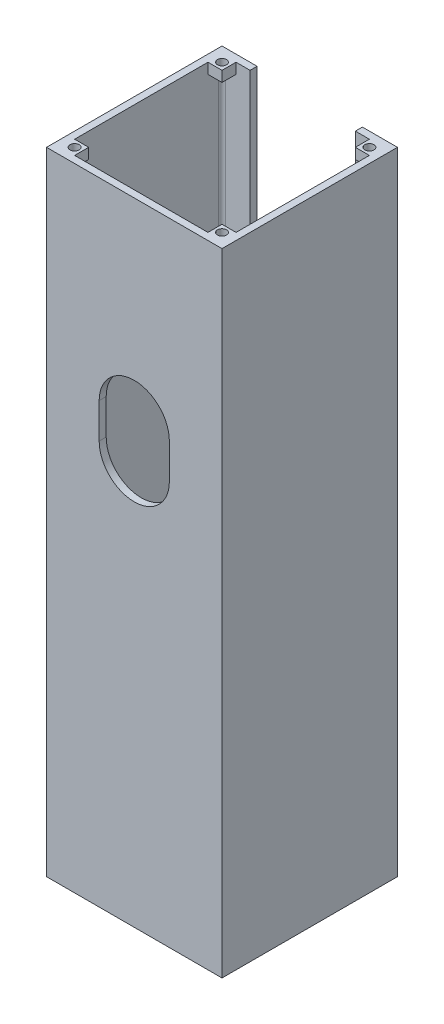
from build123d import *

# Parameters (mm, degrees)
SKETCH2_W           = 63.5
SKETCH2_H           = 63.5
BOSS_EXTRUDE2_DEPTH = 304.8
SKETCH3_W           = 58.42
SKETCH3_H           = 58.42
CUT_EXTRUDE2_DEPTH  = 302.26
SKETCH5_W           = 63.5
SKETCH5_H           = 63.5
CUT_EXTRUDE3_DEPTH  = 2.54
SKETCH6_R           = 12.7
CUT_EXTRUDE4_DEPTH  = 12.7
SKETCH11_R          = 12.7
CUT_EXTRUDE7_DEPTH  = 2.54
CUT_EXTRUDE8_DEPTH  = 2.54
SKETCH14_W          = 38.1
SKETCH14_H          = 276.86
CUT_EXTRUDE9_DEPTH  = 2.54
FILLET1_R           = 1.27
SKETCH15_W          = 63.5
SKETCH15_H          = 63.5
CUT_EXTRUDE10_DEPTH = 73.66
BOSS_EXTRUDE3_START = -3.81
SKETCH16_R          = 1.651
SKETCH16_W          = 5.08
SKETCH16_H          = 5.08
BOSS_EXTRUDE3_DEPTH = 3.81
CUT_EXTRUDE11_DEPTH = 3.81


with BuildPart() as part:
    # Sketch2 → Boss-Extrude2 (new body)
    with BuildSketch(Plane(origin=(0, 0, 0), x_dir=(1, 0, 0), z_dir=(0, 1, 0))):
        with Locations((31.75, 31.75)):
            Rectangle(SKETCH2_W, SKETCH2_H)
    extrude(amount=-BOSS_EXTRUDE2_DEPTH)

    # Sketch3 → Cut-Extrude2 (cut)
    with BuildSketch(Plane(origin=(0, 0, 0), x_dir=(1, 0, 0), z_dir=(0, 1, 0))):
        with Locations((31.75, 31.75)):
            Rectangle(SKETCH3_W, SKETCH3_H)
    extrude(amount=-CUT_EXTRUDE2_DEPTH, mode=Mode.SUBTRACT)

    # Sketch5 → Cut-Extrude3 (cut)
    with BuildSketch(Plane(origin=(0, 0, 0), x_dir=(1, 0, 0), z_dir=(0, 1, 0))):
        with Locations((31.75, 31.75)):
            Rectangle(SKETCH5_W, SKETCH5_H)
    extrude(amount=-CUT_EXTRUDE3_DEPTH, mode=Mode.SUBTRACT)

    # Sketch6 → Cut-Extrude4 (cut)
    with BuildSketch(Plane.XY):
        with Locations((31.75, -152.4)):
            Circle(SKETCH6_R)
    extrude(amount=-CUT_EXTRUDE4_DEPTH, mode=Mode.SUBTRACT)

    # Sketch11 → Cut-Extrude7 (cut)
    with BuildSketch(Plane.XY):
        with BuildLine():
            ThreePointArc((19.453277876, -155.575), (19.151222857, -154.000254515), (19.05, -152.4))
            Line((19.05, -152.4), (19.05, -158.75))
            ThreePointArc((19.05, -158.75), (19.151222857, -157.149745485), (19.453277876, -155.575))
        make_face()
        with Locations((31.75, -158.75)):
            Circle(SKETCH11_R)
        with Locations((31.75, -152.4)):
            Circle(SKETCH11_R)
        with BuildLine():
            Line((44.45, -158.75), (44.45, -152.4))
            ThreePointArc((44.45, -152.4), (44.348777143, -154.000254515), (44.046722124, -155.575))
            ThreePointArc((44.046722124, -155.575), (44.348777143, -157.149745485), (44.45, -158.75))
        make_face()
    extrude(amount=-CUT_EXTRUDE7_DEPTH, mode=Mode.SUBTRACT)

    # Sketch12 → Cut-Extrude8 (cut)
    with BuildSketch(Plane.XY):
        with BuildLine():
            ThreePointArc((44.45, -146.05), (31.75, -133.35), (19.05, -146.05))
            ThreePointArc((19.05, -146.05), (19.151222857, -147.650254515), (19.453277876, -149.225))
            ThreePointArc((19.453277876, -149.225), (31.75, -139.7), (44.046722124, -149.225))
            ThreePointArc((44.046722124, -149.225), (44.348777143, -147.650254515), (44.45, -146.05))
        make_face()
        with BuildLine():
            ThreePointArc((19.453277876, -149.225), (19.151222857, -147.650254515), (19.05, -146.05))
            Line((19.05, -146.05), (19.05, -152.4))
            ThreePointArc((19.05, -152.4), (19.151222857, -150.799745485), (19.453277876, -149.225))
        make_face()
        with BuildLine():
            Line((44.45, -152.4), (44.45, -146.05))
            ThreePointArc((44.45, -146.05), (44.348777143, -147.650254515), (44.046722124, -149.225))
            ThreePointArc((44.046722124, -149.225), (44.348777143, -150.799745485), (44.45, -152.4))
        make_face()
    extrude(amount=-CUT_EXTRUDE8_DEPTH, mode=Mode.SUBTRACT)

    # Sketch14 → Cut-Extrude9 (cut)
    with BuildSketch(Plane(origin=(0, 0, -63.5), x_dir=(-1, 0, 0), z_dir=(0, 0, -1))):
        with Locations((-31.75, -153.67)):
            Rectangle(SKETCH14_W, SKETCH14_H)
    extrude(amount=-CUT_EXTRUDE9_DEPTH, mode=Mode.SUBTRACT)

    # Fillet1
    fillet1_edges = [part.edges().sort_by_distance(p)[0] for p in [
        (60.96, -152.4, -2.54),
        (2.54, -152.4, -2.54),
        (2.54, -152.4, -60.96),
        (60.96, -152.4, -60.96),
    ]]
    fillet(fillet1_edges, radius=FILLET1_R)

    # Sketch15 → Cut-Extrude10 (cut)
    with BuildSketch(Plane(origin=(63.5, -2.54, 0), x_dir=(1, 0, 0), z_dir=(0, 1, 0))):
        with Locations((-31.75, 31.75)):
            Rectangle(SKETCH15_W, SKETCH15_H)
    extrude(amount=-CUT_EXTRUDE10_DEPTH, mode=Mode.SUBTRACT)

    # Sketch16 → Boss-Extrude3 (add)
    # profile 1 of 4: a face of its own
    with BuildSketch(Plane(origin=(0, -76.2, 0), x_dir=(1, 0, 0), z_dir=(0, 1, 0)).offset(BOSS_EXTRUDE3_START)):
        with BuildLine():
            Line((7.62, 60.96), (3.81, 60.96))
            ThreePointArc((3.81, 60.96), (2.911974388, 60.588025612), (2.54, 59.69))
            Line((2.54, 59.69), (2.54, 55.88))
            Line((2.54, 55.88), (7.62, 55.88))
            Line((7.62, 55.88), (7.62, 60.96))
        make_face()
        with Locations(Location((5.08, 58.42, 0), (0, 0, 270))):
            Circle(SKETCH16_R, mode=Mode.SUBTRACT)
    # profile 2 of 4: a face of its own
    with BuildSketch(Plane(origin=(0, -76.2, 0), x_dir=(1, 0, 0), z_dir=(0, 1, 0)).offset(BOSS_EXTRUDE3_START)):
        with BuildLine():
            Line((55.88, 55.88), (60.96, 55.88))
            Line((60.96, 55.88), (60.96, 59.69))
            ThreePointArc((60.96, 59.69), (60.588025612, 60.588025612), (59.69, 60.96))
            Line((59.69, 60.96), (55.88, 60.96))
            Line((55.88, 60.96), (55.88, 55.88))
        make_face()
        with Locations(Location((58.42, 58.42, 0), (0, 0, 270))):
            Circle(SKETCH16_R, mode=Mode.SUBTRACT)
    # profile 3 of 4: a face of its own
    with BuildSketch(Plane(origin=(0, -76.2, 0), x_dir=(1, 0, 0), z_dir=(0, 1, 0)).offset(BOSS_EXTRUDE3_START)):
        with BuildLine():
            Line((7.62, 7.62), (2.54, 7.62))
            Line((2.54, 7.62), (2.54, 3.81))
            ThreePointArc((2.54, 3.81), (2.911974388, 2.911974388), (3.81, 2.54))
            Line((3.81, 2.54), (7.62, 2.54))
            Line((7.62, 2.54), (7.62, 7.62))
        make_face()
        with Locations(Location((5.08, 5.08, 0), (0, 0, 270))):
            Circle(SKETCH16_R, mode=Mode.SUBTRACT)
    # profile 4 of 4: a face of its own
    with BuildSketch(Plane(origin=(0, -76.2, 0), x_dir=(1, 0, 0), z_dir=(0, 1, 0)).offset(BOSS_EXTRUDE3_START)):
        with Locations((58.42, 5.08)):
            Rectangle(SKETCH16_W, SKETCH16_H)
    extrude(amount=BOSS_EXTRUDE3_DEPTH)

    # Sketch17 → Cut-Extrude11 (cut)
    with BuildSketch(Plane(origin=(0, -76.2, 0), x_dir=(1, 0, 0), z_dir=(0, 1, 0))):
        with BuildLine():
            ThreePointArc((57.252566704, 6.247433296), (56.769, 5.08), (57.252566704, 3.912566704))
            Line((57.252566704, 3.912566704), (58.42, 5.08))
            Line((58.42, 5.08), (57.252566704, 6.247433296))
        make_face()
        with BuildLine():
            Line((58.42, 5.08), (57.252566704, 3.912566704))
            ThreePointArc((57.252566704, 3.912566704), (58.42, 3.429), (59.587433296, 3.912566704))
            Line((59.587433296, 3.912566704), (58.42, 5.08))
        make_face()
        with BuildLine():
            Line((57.252566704, 6.247433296), (58.42, 5.08))
            Line((58.42, 5.08), (59.587433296, 6.247433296))
            ThreePointArc((59.587433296, 6.247433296), (58.42, 6.731), (57.252566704, 6.247433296))
        make_face()
        with BuildLine():
            Line((59.587433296, 6.247433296), (58.42, 5.08))
            Line((58.42, 5.08), (59.587433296, 3.912566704))
            ThreePointArc((59.587433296, 3.912566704), (59.945325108, 4.448189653), (60.071, 5.08))
            ThreePointArc((60.071, 5.08), (59.945325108, 5.711810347), (59.587433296, 6.247433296))
        make_face()
        with BuildLine():
            ThreePointArc((57.252566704, 6.247433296), (56.769, 5.08), (57.252566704, 3.912566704))
            Line((57.252566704, 3.912566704), (58.42, 5.08))
            Line((58.42, 5.08), (57.252566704, 6.247433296))
        make_face()
        with BuildLine():
            Line((58.42, 5.08), (57.252566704, 3.912566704))
            ThreePointArc((57.252566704, 3.912566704), (58.42, 3.429), (59.587433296, 3.912566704))
            Line((59.587433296, 3.912566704), (58.42, 5.08))
        make_face()
        with BuildLine():
            Line((57.252566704, 6.247433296), (58.42, 5.08))
            Line((58.42, 5.08), (59.587433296, 6.247433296))
            ThreePointArc((59.587433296, 6.247433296), (58.42, 6.731), (57.252566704, 6.247433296))
        make_face()
        with BuildLine():
            Line((59.587433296, 6.247433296), (58.42, 5.08))
            Line((58.42, 5.08), (59.587433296, 3.912566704))
            ThreePointArc((59.587433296, 3.912566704), (59.945325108, 4.448189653), (60.071, 5.08))
            ThreePointArc((60.071, 5.08), (59.945325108, 5.711810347), (59.587433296, 6.247433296))
        make_face()
        with BuildLine():
            ThreePointArc((57.252566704, 6.247433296), (56.769, 5.08), (57.252566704, 3.912566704))
            Line((57.252566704, 3.912566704), (58.42, 5.08))
            Line((58.42, 5.08), (57.252566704, 6.247433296))
        make_face()
        with BuildLine():
            Line((58.42, 5.08), (57.252566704, 3.912566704))
            ThreePointArc((57.252566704, 3.912566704), (58.42, 3.429), (59.587433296, 3.912566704))
            Line((59.587433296, 3.912566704), (58.42, 5.08))
        make_face()
        with BuildLine():
            Line((57.252566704, 6.247433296), (58.42, 5.08))
            Line((58.42, 5.08), (59.587433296, 6.247433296))
            ThreePointArc((59.587433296, 6.247433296), (58.42, 6.731), (57.252566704, 6.247433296))
        make_face()
        with BuildLine():
            Line((59.587433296, 6.247433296), (58.42, 5.08))
            Line((58.42, 5.08), (59.587433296, 3.912566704))
            ThreePointArc((59.587433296, 3.912566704), (59.945325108, 4.448189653), (60.071, 5.08))
            ThreePointArc((60.071, 5.08), (59.945325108, 5.711810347), (59.587433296, 6.247433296))
        make_face()
        with BuildLine():
            ThreePointArc((57.252566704, 6.247433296), (56.769, 5.08), (57.252566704, 3.912566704))
            Line((57.252566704, 3.912566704), (58.42, 5.08))
            Line((58.42, 5.08), (57.252566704, 6.247433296))
        make_face()
        with BuildLine():
            Line((58.42, 5.08), (57.252566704, 3.912566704))
            ThreePointArc((57.252566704, 3.912566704), (58.42, 3.429), (59.587433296, 3.912566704))
            Line((59.587433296, 3.912566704), (58.42, 5.08))
        make_face()
        with BuildLine():
            Line((57.252566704, 6.247433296), (58.42, 5.08))
            Line((58.42, 5.08), (59.587433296, 6.247433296))
            ThreePointArc((59.587433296, 6.247433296), (58.42, 6.731), (57.252566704, 6.247433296))
        make_face()
        with BuildLine():
            Line((59.587433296, 6.247433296), (58.42, 5.08))
            Line((58.42, 5.08), (59.587433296, 3.912566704))
            ThreePointArc((59.587433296, 3.912566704), (59.945325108, 4.448189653), (60.071, 5.08))
            ThreePointArc((60.071, 5.08), (59.945325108, 5.711810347), (59.587433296, 6.247433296))
        make_face()
    extrude(amount=-CUT_EXTRUDE11_DEPTH, mode=Mode.SUBTRACT)


solid = part.part
